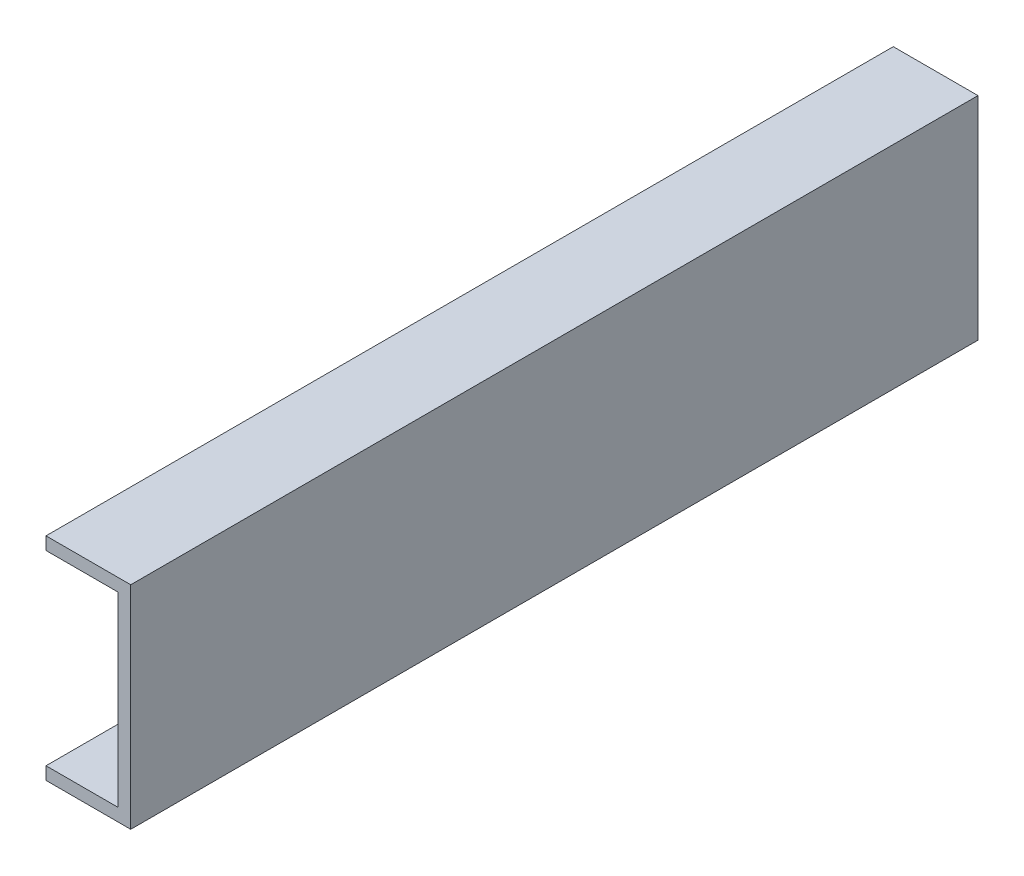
ISO-10303-21;
HEADER;
FILE_DESCRIPTION(('STEP AP214'),'2;1');
FILE_NAME('part.step','',(''),(''),'','','');
FILE_SCHEMA(('AUTOMOTIVE_DESIGN { 1 0 10303 214 1 1 1 1 }'));
ENDSEC;
DATA;
#1=APPLICATION_CONTEXT('core data for automotive mechanical design processes');
#2=APPLICATION_PROTOCOL_DEFINITION('international standard','automotive_design',2000,#1);
#3=PRODUCT_CONTEXT('',#1,'mechanical');
#4=PRODUCT('Part','Part','',(#3));
#5=PRODUCT_RELATED_PRODUCT_CATEGORY('part','',(#4));
#6=PRODUCT_DEFINITION_FORMATION('','',#4);
#7=PRODUCT_DEFINITION_CONTEXT('part definition',#1,'design');
#8=PRODUCT_DEFINITION('design','',#6,#7);
#9=PRODUCT_DEFINITION_SHAPE('','',#8);
#10=(LENGTH_UNIT() NAMED_UNIT(*) SI_UNIT(.MILLI.,.METRE.));
#11=(NAMED_UNIT(*) PLANE_ANGLE_UNIT() SI_UNIT($,.RADIAN.));
#12=(NAMED_UNIT(*) SI_UNIT($,.STERADIAN.) SOLID_ANGLE_UNIT());
#13=UNCERTAINTY_MEASURE_WITH_UNIT(LENGTH_MEASURE(1.E-05),#10,'distance_accuracy_value','');
#14=(GEOMETRIC_REPRESENTATION_CONTEXT(3) GLOBAL_UNCERTAINTY_ASSIGNED_CONTEXT((#13)) GLOBAL_UNIT_ASSIGNED_CONTEXT((#10,
#11,#12)) REPRESENTATION_CONTEXT('',''));
#15=CARTESIAN_POINT('',(0.,0.,0.));
#16=DIRECTION('',(0.,0.,1.));
#17=DIRECTION('',(1.,0.,0.));
#18=AXIS2_PLACEMENT_3D('',#15,#16,#17);
#19=CARTESIAN_POINT('',(0.,-22.,200.));
#20=DIRECTION('',(0.,-1.,0.));
#21=DIRECTION('',(0.,0.,-1.));
#22=AXIS2_PLACEMENT_3D('',#19,#20,#21);
#23=PLANE('',#22);
#24=DIRECTION('',(1.,0.,0.));
#25=VECTOR('',#24,1.);
#26=CARTESIAN_POINT('',(0.,-22.,0.));
#27=LINE('',#26,#25);
#28=CARTESIAN_POINT('',(-2.99999999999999,-22.,0.));
#29=VERTEX_POINT('',#28);
#30=CARTESIAN_POINT('',(-20.,-22.,0.));
#31=VERTEX_POINT('',#30);
#32=EDGE_CURVE('E99',#29,#31,#27,.F.);
#33=ORIENTED_EDGE('',*,*,#32,.T.);
#34=DIRECTION('',(0.,0.,-1.));
#35=VECTOR('',#34,1.);
#36=CARTESIAN_POINT('',(-20.,-22.,200.));
#37=LINE('',#36,#35);
#38=CARTESIAN_POINT('',(-20.,-22.,200.));
#39=VERTEX_POINT('',#38);
#40=EDGE_CURVE('E11',#39,#31,#37,.T.);
#41=ORIENTED_EDGE('',*,*,#40,.F.);
#42=DIRECTION('',(1.,0.,0.));
#43=VECTOR('',#42,1.);
#44=CARTESIAN_POINT('',(0.,-22.,200.));
#45=LINE('',#44,#43);
#46=CARTESIAN_POINT('',(-2.99999999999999,-22.,200.));
#47=VERTEX_POINT('',#46);
#48=EDGE_CURVE('E123',#47,#39,#45,.F.);
#49=ORIENTED_EDGE('',*,*,#48,.F.);
#50=DIRECTION('',(0.,0.,-1.));
#51=VECTOR('',#50,1.);
#52=CARTESIAN_POINT('',(-2.99999999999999,-22.,200.));
#53=LINE('',#52,#51);
#54=EDGE_CURVE('E100',#47,#29,#53,.T.);
#55=ORIENTED_EDGE('',*,*,#54,.T.);
#56=EDGE_LOOP('',(#33,#41,#49,#55));
#57=FACE_BOUND('',#56,.T.);
#58=ADVANCED_FACE('F24',(#57),#23,.F.);
#59=CARTESIAN_POINT('',(-20.,-25.,200.));
#60=DIRECTION('',(-1.,0.,0.));
#61=DIRECTION('',(0.,0.,1.));
#62=AXIS2_PLACEMENT_3D('',#59,#60,#61);
#63=PLANE('',#62);
#64=DIRECTION('',(0.,1.,0.));
#65=VECTOR('',#64,1.);
#66=CARTESIAN_POINT('',(-20.,-25.,0.));
#67=LINE('',#66,#65);
#68=CARTESIAN_POINT('',(-20.,-25.,0.));
#69=VERTEX_POINT('',#68);
#70=EDGE_CURVE('E91',#69,#31,#67,.T.);
#71=ORIENTED_EDGE('',*,*,#70,.F.);
#72=DIRECTION('',(0.,0.,-1.));
#73=VECTOR('',#72,1.);
#74=CARTESIAN_POINT('',(-20.,-25.,200.));
#75=LINE('',#74,#73);
#76=CARTESIAN_POINT('',(-20.,-25.,200.));
#77=VERTEX_POINT('',#76);
#78=EDGE_CURVE('E31',#77,#69,#75,.T.);
#79=ORIENTED_EDGE('',*,*,#78,.F.);
#80=DIRECTION('',(0.,1.,0.));
#81=VECTOR('',#80,1.);
#82=CARTESIAN_POINT('',(-20.,-25.,200.));
#83=LINE('',#82,#81);
#84=EDGE_CURVE('E94',#77,#39,#83,.T.);
#85=ORIENTED_EDGE('',*,*,#84,.T.);
#86=ORIENTED_EDGE('',*,*,#40,.T.);
#87=EDGE_LOOP('',(#71,#79,#85,#86));
#88=FACE_BOUND('',#87,.T.);
#89=ADVANCED_FACE('F89',(#88),#63,.T.);
#90=CARTESIAN_POINT('',(0.,-25.,200.));
#91=DIRECTION('',(0.,-1.,0.));
#92=DIRECTION('',(0.,0.,-1.));
#93=AXIS2_PLACEMENT_3D('',#90,#91,#92);
#94=PLANE('',#93);
#95=DIRECTION('',(-1.,0.,0.));
#96=VECTOR('',#95,1.);
#97=CARTESIAN_POINT('',(0.,-25.,0.));
#98=LINE('',#97,#96);
#99=CARTESIAN_POINT('',(0.,-25.,0.));
#100=VERTEX_POINT('',#99);
#101=EDGE_CURVE('E107',#100,#69,#98,.T.);
#102=ORIENTED_EDGE('',*,*,#101,.F.);
#103=DIRECTION('',(0.,0.,-1.));
#104=VECTOR('',#103,1.);
#105=CARTESIAN_POINT('',(0.,-25.,200.));
#106=LINE('',#105,#104);
#107=CARTESIAN_POINT('',(0.,-25.,200.));
#108=VERTEX_POINT('',#107);
#109=EDGE_CURVE('E150',#108,#100,#106,.T.);
#110=ORIENTED_EDGE('',*,*,#109,.F.);
#111=DIRECTION('',(-1.,0.,0.));
#112=VECTOR('',#111,1.);
#113=CARTESIAN_POINT('',(0.,-25.,200.));
#114=LINE('',#113,#112);
#115=EDGE_CURVE('E126',#108,#77,#114,.T.);
#116=ORIENTED_EDGE('',*,*,#115,.T.);
#117=ORIENTED_EDGE('',*,*,#78,.T.);
#118=EDGE_LOOP('',(#102,#110,#116,#117));
#119=FACE_BOUND('',#118,.T.);
#120=ADVANCED_FACE('F152',(#119),#94,.T.);
#121=CARTESIAN_POINT('',(0.,25.,200.));
#122=DIRECTION('',(1.,0.,0.));
#123=DIRECTION('',(0.,0.,-1.));
#124=AXIS2_PLACEMENT_3D('',#121,#122,#123);
#125=PLANE('',#124);
#126=DIRECTION('',(0.,-1.,0.));
#127=VECTOR('',#126,1.);
#128=CARTESIAN_POINT('',(0.,25.,0.));
#129=LINE('',#128,#127);
#130=CARTESIAN_POINT('',(0.,25.,0.));
#131=VERTEX_POINT('',#130);
#132=EDGE_CURVE('E109',#131,#100,#129,.T.);
#133=ORIENTED_EDGE('',*,*,#132,.F.);
#134=DIRECTION('',(0.,0.,-1.));
#135=VECTOR('',#134,1.);
#136=CARTESIAN_POINT('',(0.,25.,200.));
#137=LINE('',#136,#135);
#138=CARTESIAN_POINT('',(0.,25.,200.));
#139=VERTEX_POINT('',#138);
#140=EDGE_CURVE('E148',#139,#131,#137,.T.);
#141=ORIENTED_EDGE('',*,*,#140,.F.);
#142=DIRECTION('',(0.,-1.,0.));
#143=VECTOR('',#142,1.);
#144=CARTESIAN_POINT('',(0.,25.,200.));
#145=LINE('',#144,#143);
#146=EDGE_CURVE('E129',#139,#108,#145,.T.);
#147=ORIENTED_EDGE('',*,*,#146,.T.);
#148=ORIENTED_EDGE('',*,*,#109,.T.);
#149=EDGE_LOOP('',(#133,#141,#147,#148));
#150=FACE_BOUND('',#149,.T.);
#151=ADVANCED_FACE('F159',(#150),#125,.T.);
#152=CARTESIAN_POINT('',(-20.,25.,200.));
#153=DIRECTION('',(0.,1.,0.));
#154=DIRECTION('',(0.,0.,1.));
#155=AXIS2_PLACEMENT_3D('',#152,#153,#154);
#156=PLANE('',#155);
#157=DIRECTION('',(1.,0.,0.));
#158=VECTOR('',#157,1.);
#159=CARTESIAN_POINT('',(-20.,25.,0.));
#160=LINE('',#159,#158);
#161=CARTESIAN_POINT('',(-20.,25.,0.));
#162=VERTEX_POINT('',#161);
#163=EDGE_CURVE('E113',#162,#131,#160,.T.);
#164=ORIENTED_EDGE('',*,*,#163,.F.);
#165=DIRECTION('',(0.,0.,-1.));
#166=VECTOR('',#165,1.);
#167=CARTESIAN_POINT('',(-20.,25.,200.));
#168=LINE('',#167,#166);
#169=CARTESIAN_POINT('',(-20.,25.,200.));
#170=VERTEX_POINT('',#169);
#171=EDGE_CURVE('E146',#170,#162,#168,.T.);
#172=ORIENTED_EDGE('',*,*,#171,.F.);
#173=DIRECTION('',(1.,0.,0.));
#174=VECTOR('',#173,1.);
#175=CARTESIAN_POINT('',(-20.,25.,200.));
#176=LINE('',#175,#174);
#177=EDGE_CURVE('E132',#170,#139,#176,.T.);
#178=ORIENTED_EDGE('',*,*,#177,.T.);
#179=ORIENTED_EDGE('',*,*,#140,.T.);
#180=EDGE_LOOP('',(#164,#172,#178,#179));
#181=FACE_BOUND('',#180,.T.);
#182=ADVANCED_FACE('F162',(#181),#156,.T.);
#183=CARTESIAN_POINT('',(-20.,22.,200.));
#184=DIRECTION('',(-1.,0.,0.));
#185=DIRECTION('',(0.,0.,1.));
#186=AXIS2_PLACEMENT_3D('',#183,#184,#185);
#187=PLANE('',#186);
#188=DIRECTION('',(0.,1.,0.));
#189=VECTOR('',#188,1.);
#190=CARTESIAN_POINT('',(-20.,22.,0.));
#191=LINE('',#190,#189);
#192=CARTESIAN_POINT('',(-20.,22.,0.));
#193=VERTEX_POINT('',#192);
#194=EDGE_CURVE('E116',#193,#162,#191,.T.);
#195=ORIENTED_EDGE('',*,*,#194,.F.);
#196=DIRECTION('',(0.,0.,-1.));
#197=VECTOR('',#196,1.);
#198=CARTESIAN_POINT('',(-20.,22.,200.));
#199=LINE('',#198,#197);
#200=CARTESIAN_POINT('',(-20.,22.,200.));
#201=VERTEX_POINT('',#200);
#202=EDGE_CURVE('E144',#201,#193,#199,.T.);
#203=ORIENTED_EDGE('',*,*,#202,.F.);
#204=DIRECTION('',(0.,1.,0.));
#205=VECTOR('',#204,1.);
#206=CARTESIAN_POINT('',(-20.,22.,200.));
#207=LINE('',#206,#205);
#208=EDGE_CURVE('E135',#201,#170,#207,.T.);
#209=ORIENTED_EDGE('',*,*,#208,.T.);
#210=ORIENTED_EDGE('',*,*,#171,.T.);
#211=EDGE_LOOP('',(#195,#203,#209,#210));
#212=FACE_BOUND('',#211,.T.);
#213=ADVANCED_FACE('F165',(#212),#187,.T.);
#214=CARTESIAN_POINT('',(-20.,22.,200.));
#215=DIRECTION('',(0.,1.,0.));
#216=DIRECTION('',(0.,0.,1.));
#217=AXIS2_PLACEMENT_3D('',#214,#215,#216);
#218=PLANE('',#217);
#219=DIRECTION('',(1.,0.,0.));
#220=VECTOR('',#219,1.);
#221=CARTESIAN_POINT('',(-20.,22.,0.));
#222=LINE('',#221,#220);
#223=CARTESIAN_POINT('',(-2.99999999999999,22.,0.));
#224=VERTEX_POINT('',#223);
#225=EDGE_CURVE('E119',#193,#224,#222,.T.);
#226=ORIENTED_EDGE('',*,*,#225,.T.);
#227=DIRECTION('',(0.,0.,-1.));
#228=VECTOR('',#227,1.);
#229=CARTESIAN_POINT('',(-2.99999999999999,22.,200.));
#230=LINE('',#229,#228);
#231=CARTESIAN_POINT('',(-2.99999999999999,22.,200.));
#232=VERTEX_POINT('',#231);
#233=EDGE_CURVE('E141',#232,#224,#230,.T.);
#234=ORIENTED_EDGE('',*,*,#233,.F.);
#235=DIRECTION('',(1.,0.,0.));
#236=VECTOR('',#235,1.);
#237=CARTESIAN_POINT('',(-20.,22.,200.));
#238=LINE('',#237,#236);
#239=EDGE_CURVE('E43',#201,#232,#238,.T.);
#240=ORIENTED_EDGE('',*,*,#239,.F.);
#241=ORIENTED_EDGE('',*,*,#202,.T.);
#242=EDGE_LOOP('',(#226,#234,#240,#241));
#243=FACE_BOUND('',#242,.T.);
#244=ADVANCED_FACE('F168',(#243),#218,.F.);
#245=CARTESIAN_POINT('',(-2.99999999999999,25.,200.));
#246=DIRECTION('',(1.,0.,0.));
#247=DIRECTION('',(0.,0.,-1.));
#248=AXIS2_PLACEMENT_3D('',#245,#246,#247);
#249=PLANE('',#248);
#250=DIRECTION('',(0.,1.,0.));
#251=VECTOR('',#250,1.);
#252=CARTESIAN_POINT('',(-2.99999999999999,25.,0.));
#253=LINE('',#252,#251);
#254=EDGE_CURVE('E121',#224,#29,#253,.F.);
#255=ORIENTED_EDGE('',*,*,#254,.T.);
#256=ORIENTED_EDGE('',*,*,#54,.F.);
#257=DIRECTION('',(0.,1.,0.));
#258=VECTOR('',#257,1.);
#259=CARTESIAN_POINT('',(-2.99999999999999,25.,200.));
#260=LINE('',#259,#258);
#261=EDGE_CURVE('E38',#232,#47,#260,.F.);
#262=ORIENTED_EDGE('',*,*,#261,.F.);
#263=ORIENTED_EDGE('',*,*,#233,.T.);
#264=EDGE_LOOP('',(#255,#256,#262,#263));
#265=FACE_BOUND('',#264,.T.);
#266=ADVANCED_FACE('F170',(#265),#249,.F.);
#267=CARTESIAN_POINT('',(-20.,-22.,200.));
#268=DIRECTION('',(0.,0.,1.));
#269=DIRECTION('',(1.,0.,0.));
#270=AXIS2_PLACEMENT_3D('',#267,#268,#269);
#271=PLANE('',#270);
#272=ORIENTED_EDGE('',*,*,#48,.T.);
#273=ORIENTED_EDGE('',*,*,#84,.F.);
#274=ORIENTED_EDGE('',*,*,#115,.F.);
#275=ORIENTED_EDGE('',*,*,#146,.F.);
#276=ORIENTED_EDGE('',*,*,#177,.F.);
#277=ORIENTED_EDGE('',*,*,#208,.F.);
#278=ORIENTED_EDGE('',*,*,#239,.T.);
#279=ORIENTED_EDGE('',*,*,#261,.T.);
#280=EDGE_LOOP('',(#272,#273,#274,#275,#276,#277,#278,#279));
#281=FACE_BOUND('',#280,.T.);
#282=ADVANCED_FACE('F154',(#281),#271,.T.);
#283=CARTESIAN_POINT('',(-20.,-22.,0.));
#284=DIRECTION('',(0.,0.,1.));
#285=DIRECTION('',(1.,0.,0.));
#286=AXIS2_PLACEMENT_3D('',#283,#284,#285);
#287=PLANE('',#286);
#288=ORIENTED_EDGE('',*,*,#32,.F.);
#289=ORIENTED_EDGE('',*,*,#254,.F.);
#290=ORIENTED_EDGE('',*,*,#225,.F.);
#291=ORIENTED_EDGE('',*,*,#194,.T.);
#292=ORIENTED_EDGE('',*,*,#163,.T.);
#293=ORIENTED_EDGE('',*,*,#132,.T.);
#294=ORIENTED_EDGE('',*,*,#101,.T.);
#295=ORIENTED_EDGE('',*,*,#70,.T.);
#296=EDGE_LOOP('',(#288,#289,#290,#291,#292,#293,#294,#295));
#297=FACE_BOUND('',#296,.T.);
#298=ADVANCED_FACE('F104',(#297),#287,.F.);
#299=CLOSED_SHELL('',(#58,#89,#120,#151,#182,#213,#244,#266,#282,#298));
#300=MANIFOLD_SOLID_BREP('B2',#299);
#301=ADVANCED_BREP_SHAPE_REPRESENTATION('',(#18,#300),#14);
#302=SHAPE_DEFINITION_REPRESENTATION(#9,#301);
ENDSEC;
END-ISO-10303-21;
